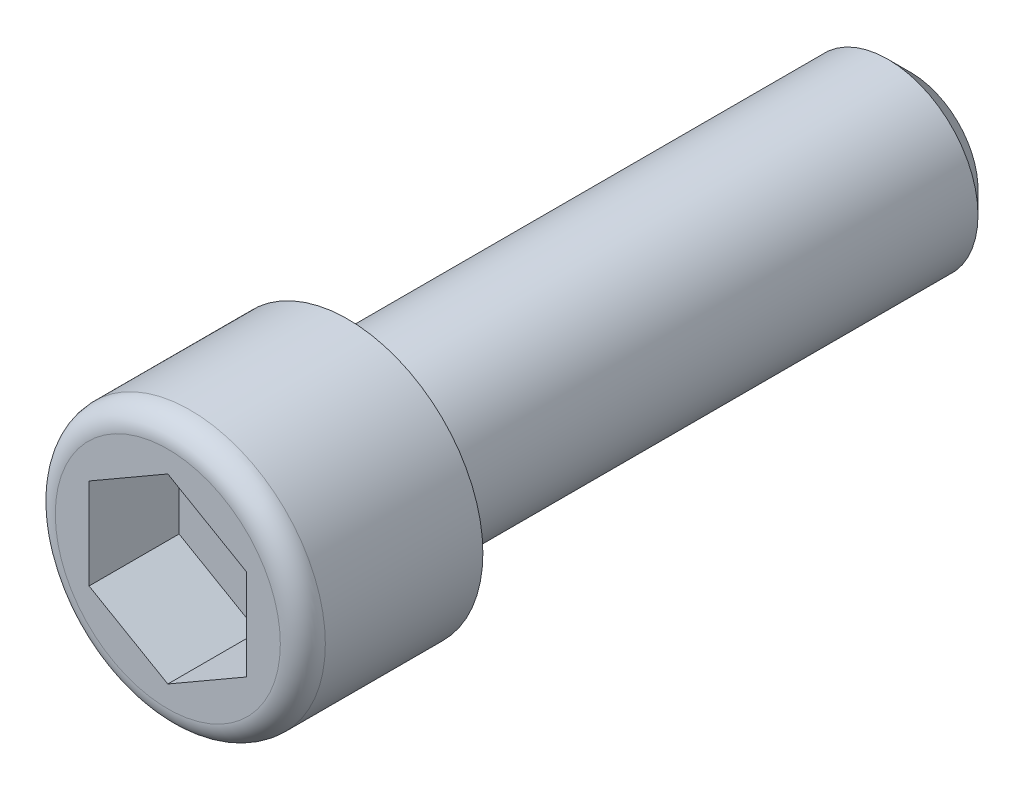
from build123d import *

# Parameters (mm, degrees)
ESQUISSE1_R             = 6
BASE_EXTRUSION_DEPTH    = 8
ESQUISSE2_R             = 4
BOSS_EXTRU_1_DEPTH      = 25
CHANFREIN1_SIZE         = 1
ENL_V_MAT_EXTRU_1_DEPTH = 4
CONG_1_R                = 1


with BuildPart() as part:
    # Esquisse1 → Base-Extrusion (new body)
    with BuildSketch(Plane.XY):
        Circle(ESQUISSE1_R)
    extrude(amount=-BASE_EXTRUSION_DEPTH)

    # Esquisse2 → Boss.-Extru.1 (add)
    with BuildSketch(Plane(origin=(0, 0, -8), x_dir=(-1, 0, 0), z_dir=(0, 0, -1))):
        with Locations(Location((0, 0, 0), (0, 0, 180))):
            Circle(ESQUISSE2_R)
    extrude(amount=BOSS_EXTRU_1_DEPTH)

    # Chanfrein1
    chanfrein1_edges = [part.edges().sort_by_distance(p)[0] for p in [
        (-4, 0, -33),
    ]]
    chamfer(chanfrein1_edges, length=CHANFREIN1_SIZE)

    # Esquisse3 → Enl_v. mat.-Extru.1 (cut)
    with BuildSketch(Plane.XY):
        Polygon((-3.5, -2.020725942), (0, -4.041451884), (3.5, -2.020725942), (3.5, 2.020725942), (0, 4.041451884), (-3.5, 2.020725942), align=None)
    extrude(amount=-ENL_V_MAT_EXTRU_1_DEPTH, mode=Mode.SUBTRACT)

    # Cong_1
    cong_1_edges = [part.edges().sort_by_distance(p)[0] for p in [
        (-6, 0, 0),
    ]]
    fillet(cong_1_edges, radius=CONG_1_R)


solid = part.part
